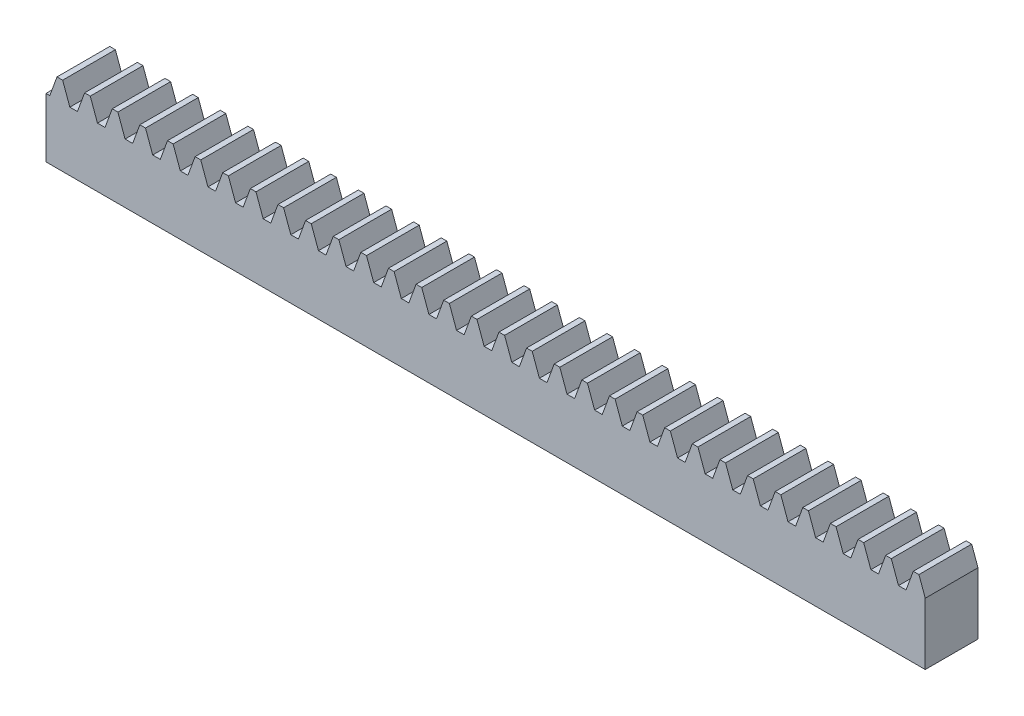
from build123d import *

# Parameters (mm, degrees)
BLANKSKE_W        = 500
BLANKSKE_H        = 45
BLANK_DEPTH       = 30
TOOTHCUTSIM_DEPTH = 503.916494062
TEETHCUTS_COUNT   = 33
TEETHCUTS_PITCH   = 15.70796325
SCALE1_SCALE      = 0.25


with BuildPart() as part:
    # BlankSke → Blank (new body)
    with BuildSketch(Plane.XY):
        with Locations((250, 22.5)):
            Rectangle(BLANKSKE_W, BLANKSKE_H)
    extrude(amount=-BLANK_DEPTH)

    # TooCutSkeSim → ToothCutSim (cut, through all)
    with BuildSketch(Plane.XY):
        Polygon((2.153176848, 33.75), (-2.153176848, 33.75), (-6.257086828, 45.0254), (6.257086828, 45.0254), align=None)
    toothcutsim = extrude(amount=-TOOTHCUTSIM_DEPTH, mode=Mode.SUBTRACT)

    # TeethCuts: ToothCutSim ×33
    with Locations(*[(i * TEETHCUTS_PITCH, 0, 0) for i in range(1, TEETHCUTS_COUNT)]):
        add(toothcutsim, mode=Mode.SUBTRACT)


with BuildPart() as part_1:
    # Scale1: scaled about (250.174583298, 19.767382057, -15)
    add(part.part.scale(SCALE1_SCALE).moved(Location((187.630937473, 14.825536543, -11.25))))


solid = part_1.part
